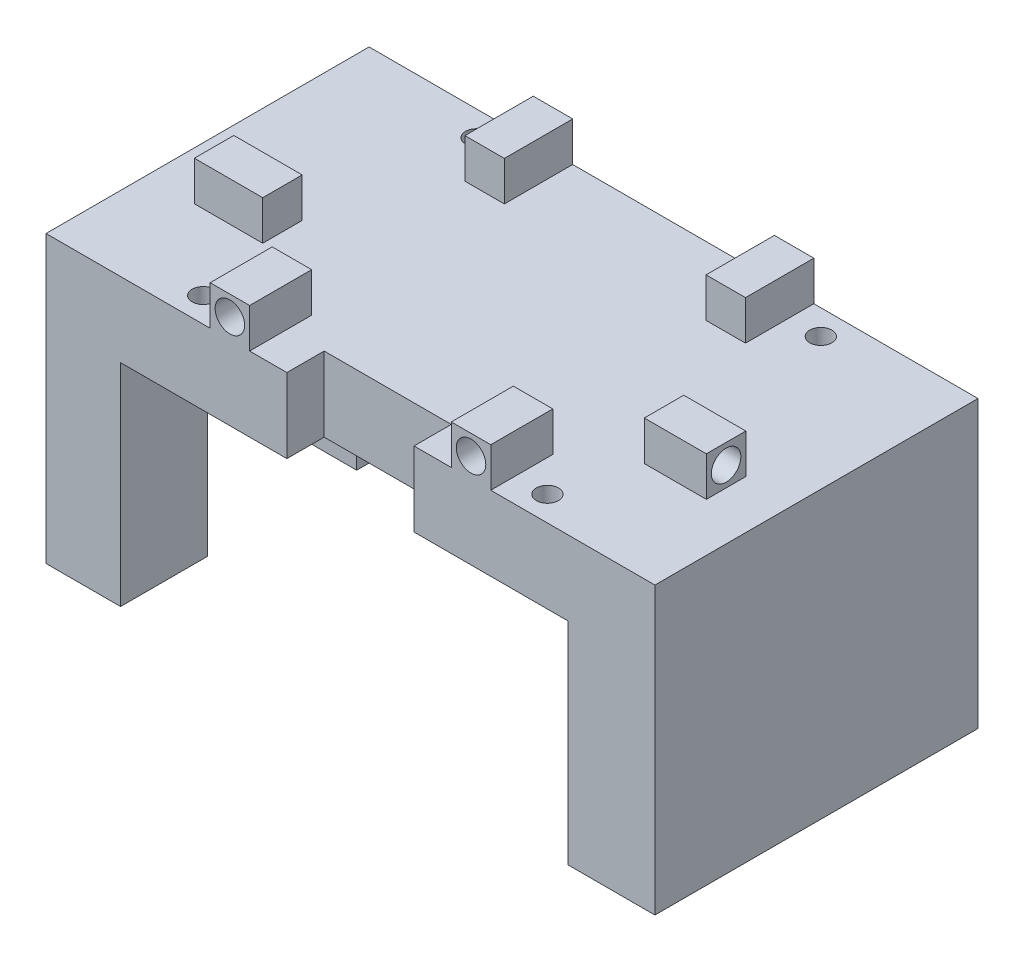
from build123d import *

# Parameters (mm, degrees)
SKETCH1_W                      = 49
SKETCH1_H                      = 26
BOSS_EXTRUDE1_DEPTH            = 6
SKETCH2_W                      = 6
SKETCH2_H                      = 7
SKETCH2_W_2                    = 7
SKETCH2_H_2                    = 26
BOSS_EXTRUDE2_DEPTH            = 17
SKETCH6_W                      = 3.175
SKETCH6_H                      = 4.992
SKETCH6_W_2                    = 4.992
SKETCH6_H_2                    = 3.175
SKETCH6_H_3                    = 5.5
SKETCH6_W_3                    = 5.5
BOSS_EXTRUDE3_DEPTH            = 3.175
TAP_DRILL_FOR_4_48_TAP1_D      = 2.3749
TAP_DRILL_FOR_4_48_TAP1_DEPTH  = 15
TAP_DRILL_FOR_4_48_TAP1_TIP    = 0.713491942
TAP_DRILL_FOR_4_48_TAP2_D      = 2.3749
TAP_DRILL_FOR_4_48_TAP2_DEPTH  = 20
TAP_DRILL_FOR_4_48_TAP2_TIP    = 0.713491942
SKETCH23_W                     = 10.23
SKETCH23_H                     = 3
CUT_EXTRUDE1_DEPTH             = 61.049979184
TAP_DRILL_FOR_4_40_TAP1_D      = 2.2606
TAP_DRILL_FOR_4_40_TAP1_DEPTH  = 12.7
TAP_DRILL_FOR_4_40_TAP1_TIP    = 0.679152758
F_1_8_0_1250_DOWEL_HOLE1_D     = 3.175
F_1_8_0_1250_DOWEL_HOLE1_DEPTH = 6.35
F_1_8_0_1250_DOWEL_HOLE1_TIP   = 0.953866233
TAP_DRILL_FOR_2_56_TAP1_D      = 1.778


with BuildPart() as part:
    # Sketch1 → Boss-Extrude1 (new body)
    with BuildSketch(Plane(origin=(0, 0, 0), x_dir=(1, 0, 0), z_dir=(0, 1, 0))):
        with Locations((24.5, 13)):
            Rectangle(SKETCH1_W, SKETCH1_H)
    extrude(amount=-BOSS_EXTRUDE1_DEPTH)

    # Sketch2 → Boss-Extrude2 (add)
    with BuildSketch(Plane(origin=(0, -6, 0), x_dir=(-1, 0, 0), z_dir=(0, -1, 0))):
        with Locations((-3, 3.5)):
            Rectangle(SKETCH2_W, SKETCH2_H)
        with Locations((-3, 22.5)):
            Rectangle(SKETCH2_W, SKETCH2_H)
        with Locations((-45.5, 13)):
            Rectangle(SKETCH2_W_2, SKETCH2_H_2)
    extrude(amount=BOSS_EXTRUDE2_DEPTH)

    # Sketch6 → Boss-Extrude3 (add)
    with BuildSketch(Plane(origin=(0, 0, 0), x_dir=(1, 0, 0), z_dir=(0, 1, 0))):
        with Locations((14.7975, 2.496)):
            Rectangle(SKETCH6_W, SKETCH6_H)
        with Locations((34.2025, 2.496)):
            Rectangle(SKETCH6_W, SKETCH6_H)
        with Locations((42.604, 9.6275)):
            Rectangle(SKETCH6_W_2, SKETCH6_H_2)
        with Locations((34.2025, 23.25)):
            Rectangle(SKETCH6_W, SKETCH6_H_3)
        with Locations((14.7975, 23.25)):
            Rectangle(SKETCH6_W, SKETCH6_H_3)
        with Locations((6.65, 9.6275)):
            Rectangle(SKETCH6_W_3, SKETCH6_H_2)
    extrude(amount=BOSS_EXTRUDE3_DEPTH)

    # Tap Drill for _4-48 Tap1
    with Locations(Plane.XY):
        with Locations((14.7975, 1.5875), (34.2025, 1.5875)):
            Hole(TAP_DRILL_FOR_4_48_TAP1_D / 2, depth=TAP_DRILL_FOR_4_48_TAP1_DEPTH)
            with Locations((0, 0, -(TAP_DRILL_FOR_4_48_TAP1_DEPTH + TAP_DRILL_FOR_4_48_TAP1_TIP / 2))):  # 118° drill point
                Cone(0, TAP_DRILL_FOR_4_48_TAP1_D / 2, TAP_DRILL_FOR_4_48_TAP1_TIP, mode=Mode.SUBTRACT)

    # Tap Drill for _4-48 Tap2
    with Locations(Plane(origin=(45.1, 1.5875, -9.6275), x_dir=(0, 0, 1), z_dir=(1, 0, 0))):
        with Locations((0, 0)):
            Hole(TAP_DRILL_FOR_4_48_TAP2_D / 2, depth=TAP_DRILL_FOR_4_48_TAP2_DEPTH)
            with Locations((0, 0, -(TAP_DRILL_FOR_4_48_TAP2_DEPTH + TAP_DRILL_FOR_4_48_TAP2_TIP / 2))):  # 118° drill point
                Cone(0, TAP_DRILL_FOR_4_48_TAP2_D / 2, TAP_DRILL_FOR_4_48_TAP2_TIP, mode=Mode.SUBTRACT)

    # Sketch23 → Cut-Extrude1 (cut, through all)
    with BuildSketch(Plane(origin=(0, 0, 0), x_dir=(1, 0, 0), z_dir=(0, 1, 0))):
        with Locations((24.5, 1.5)):
            Rectangle(SKETCH23_W, SKETCH23_H)
    extrude(amount=-CUT_EXTRUDE1_DEPTH, mode=Mode.SUBTRACT)

    # Tap Drill for _4-40 Tap1
    with Locations(Plane(origin=(0, -23, 0), x_dir=(-1, 0, 0), z_dir=(0, -1, 0))):
        with Locations((-45.5, 3.5), (-45.5, 22.5), (-3, 22.5), (-3, 3.5)):
            Hole(TAP_DRILL_FOR_4_40_TAP1_D / 2, depth=TAP_DRILL_FOR_4_40_TAP1_DEPTH)
            with Locations((0, 0, -(TAP_DRILL_FOR_4_40_TAP1_DEPTH + TAP_DRILL_FOR_4_40_TAP1_TIP / 2))):  # 118° drill point
                Cone(0, TAP_DRILL_FOR_4_40_TAP1_D / 2, TAP_DRILL_FOR_4_40_TAP1_TIP, mode=Mode.SUBTRACT)

    # 1_8 _0.1250_ Dowel Hole1
    with Locations(Plane(origin=(0, -23, 0), x_dir=(-1, 0, 0), z_dir=(0, -1, 0))):
        with Locations((-45.5, 10.5), (-45.5, 16.5)):
            Hole(F_1_8_0_1250_DOWEL_HOLE1_D / 2, depth=F_1_8_0_1250_DOWEL_HOLE1_DEPTH)
            with Locations((0, 0, -(F_1_8_0_1250_DOWEL_HOLE1_DEPTH + F_1_8_0_1250_DOWEL_HOLE1_TIP / 2))):  # 118° drill point
                Cone(0, F_1_8_0_1250_DOWEL_HOLE1_D / 2, F_1_8_0_1250_DOWEL_HOLE1_TIP, mode=Mode.SUBTRACT)

    # Tap Drill for _2-56 Tap1 (through all)
    with Locations(Plane(origin=(0, 0, 0), x_dir=(1, 0, 0), z_dir=(0, 1, 0))):
        with Locations((10.65, 2), (38.35, 2), (38.35, 24), (10.65, 24)):
            Hole(TAP_DRILL_FOR_2_56_TAP1_D / 2)


solid = part.part
